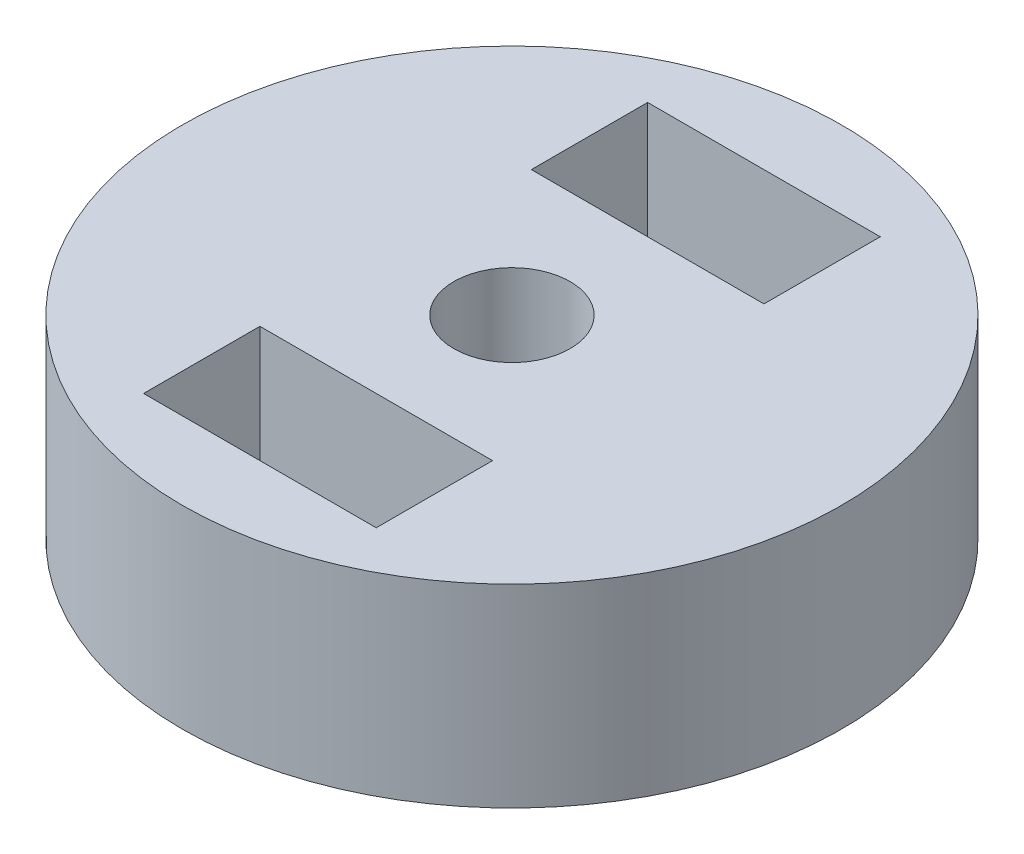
ISO-10303-21;
HEADER;
FILE_DESCRIPTION(('STEP AP214'),'2;1');
FILE_NAME('part.step','',(''),(''),'','','');
FILE_SCHEMA(('AUTOMOTIVE_DESIGN { 1 0 10303 214 1 1 1 1 }'));
ENDSEC;
DATA;
#1=APPLICATION_CONTEXT('core data for automotive mechanical design processes');
#2=APPLICATION_PROTOCOL_DEFINITION('international standard','automotive_design',2000,#1);
#3=PRODUCT_CONTEXT('',#1,'mechanical');
#4=PRODUCT('Part','Part','',(#3));
#5=PRODUCT_RELATED_PRODUCT_CATEGORY('part','',(#4));
#6=PRODUCT_DEFINITION_FORMATION('','',#4);
#7=PRODUCT_DEFINITION_CONTEXT('part definition',#1,'design');
#8=PRODUCT_DEFINITION('design','',#6,#7);
#9=PRODUCT_DEFINITION_SHAPE('','',#8);
#10=(LENGTH_UNIT() NAMED_UNIT(*) SI_UNIT(.MILLI.,.METRE.));
#11=(NAMED_UNIT(*) PLANE_ANGLE_UNIT() SI_UNIT($,.RADIAN.));
#12=(NAMED_UNIT(*) SI_UNIT($,.STERADIAN.) SOLID_ANGLE_UNIT());
#13=UNCERTAINTY_MEASURE_WITH_UNIT(LENGTH_MEASURE(1.E-05),#10,'distance_accuracy_value','');
#14=(GEOMETRIC_REPRESENTATION_CONTEXT(3) GLOBAL_UNCERTAINTY_ASSIGNED_CONTEXT((#13)) GLOBAL_UNIT_ASSIGNED_CONTEXT((#10,
#11,#12)) REPRESENTATION_CONTEXT('',''));
#15=CARTESIAN_POINT('',(0.,0.,0.));
#16=DIRECTION('',(0.,0.,1.));
#17=DIRECTION('',(1.,0.,0.));
#18=AXIS2_PLACEMENT_3D('',#15,#16,#17);
#19=CARTESIAN_POINT('',(0.,5.,0.));
#20=DIRECTION('',(0.,1.,0.));
#21=DIRECTION('',(0.,0.,1.));
#22=AXIS2_PLACEMENT_3D('',#19,#20,#21);
#23=PLANE('',#22);
#24=DIRECTION('',(0.,0.,1.));
#25=VECTOR('',#24,1.);
#26=CARTESIAN_POINT('',(-3.,5.,3.5));
#27=LINE('',#26,#25);
#28=CARTESIAN_POINT('',(-3.,5.,3.5));
#29=VERTEX_POINT('',#28);
#30=CARTESIAN_POINT('',(-3.,5.,6.5));
#31=VERTEX_POINT('',#30);
#32=EDGE_CURVE('E48',#29,#31,#27,.T.);
#33=ORIENTED_EDGE('',*,*,#32,.F.);
#34=DIRECTION('',(-1.,0.,0.));
#35=VECTOR('',#34,1.);
#36=CARTESIAN_POINT('',(-3.,5.,3.5));
#37=LINE('',#36,#35);
#38=CARTESIAN_POINT('',(3.,5.,3.5));
#39=VERTEX_POINT('',#38);
#40=EDGE_CURVE('E119',#39,#29,#37,.T.);
#41=ORIENTED_EDGE('',*,*,#40,.F.);
#42=DIRECTION('',(0.,0.,-1.));
#43=VECTOR('',#42,1.);
#44=CARTESIAN_POINT('',(3.,5.,6.5));
#45=LINE('',#44,#43);
#46=CARTESIAN_POINT('',(3.,5.,6.5));
#47=VERTEX_POINT('',#46);
#48=EDGE_CURVE('E122',#47,#39,#45,.T.);
#49=ORIENTED_EDGE('',*,*,#48,.F.);
#50=DIRECTION('',(1.,0.,0.));
#51=VECTOR('',#50,1.);
#52=CARTESIAN_POINT('',(-3.,5.,6.5));
#53=LINE('',#52,#51);
#54=EDGE_CURVE('E128',#31,#47,#53,.T.);
#55=ORIENTED_EDGE('',*,*,#54,.F.);
#56=EDGE_LOOP('',(#33,#41,#49,#55));
#57=FACE_BOUND('',#56,.T.);
#58=DIRECTION('',(0.,0.,1.));
#59=VECTOR('',#58,1.);
#60=CARTESIAN_POINT('',(-3.,5.,-6.5));
#61=LINE('',#60,#59);
#62=CARTESIAN_POINT('',(-3.,5.,-6.5));
#63=VERTEX_POINT('',#62);
#64=CARTESIAN_POINT('',(-3.,5.,-3.5));
#65=VERTEX_POINT('',#64);
#66=EDGE_CURVE('E56',#63,#65,#61,.T.);
#67=ORIENTED_EDGE('',*,*,#66,.F.);
#68=DIRECTION('',(-1.,0.,0.));
#69=VECTOR('',#68,1.);
#70=CARTESIAN_POINT('',(3.,5.,-6.5));
#71=LINE('',#70,#69);
#72=CARTESIAN_POINT('',(3.,5.,-6.5));
#73=VERTEX_POINT('',#72);
#74=EDGE_CURVE('E143',#73,#63,#71,.T.);
#75=ORIENTED_EDGE('',*,*,#74,.F.);
#76=DIRECTION('',(0.,0.,-1.));
#77=VECTOR('',#76,1.);
#78=CARTESIAN_POINT('',(3.,5.,-3.5));
#79=LINE('',#78,#77);
#80=CARTESIAN_POINT('',(3.,5.,-3.5));
#81=VERTEX_POINT('',#80);
#82=EDGE_CURVE('E157',#81,#73,#79,.T.);
#83=ORIENTED_EDGE('',*,*,#82,.F.);
#84=DIRECTION('',(1.,0.,0.));
#85=VECTOR('',#84,1.);
#86=CARTESIAN_POINT('',(-3.,5.,-3.5));
#87=LINE('',#86,#85);
#88=EDGE_CURVE('E154',#65,#81,#87,.T.);
#89=ORIENTED_EDGE('',*,*,#88,.F.);
#90=EDGE_LOOP('',(#67,#75,#83,#89));
#91=FACE_BOUND('',#90,.T.);
#92=CARTESIAN_POINT('',(0.,5.,0.));
#93=DIRECTION('',(0.,1.,0.));
#94=DIRECTION('',(0.,0.,1.));
#95=AXIS2_PLACEMENT_3D('',#92,#93,#94);
#96=CIRCLE('',#95,8.5);
#97=CARTESIAN_POINT('',(0.,5.,8.5));
#98=VERTEX_POINT('',#97);
#99=EDGE_CURVE('E11',#98,#98,#96,.T.);
#100=ORIENTED_EDGE('',*,*,#99,.T.);
#101=EDGE_LOOP('',(#100));
#102=FACE_BOUND('',#101,.T.);
#103=CARTESIAN_POINT('',(0.,5.,0.));
#104=DIRECTION('',(0.,1.,0.));
#105=DIRECTION('',(0.,0.,1.));
#106=AXIS2_PLACEMENT_3D('',#103,#104,#105);
#107=CIRCLE('',#106,1.5);
#108=CARTESIAN_POINT('',(0.,5.,1.5));
#109=VERTEX_POINT('',#108);
#110=EDGE_CURVE('E168',#109,#109,#107,.T.);
#111=ORIENTED_EDGE('',*,*,#110,.F.);
#112=EDGE_LOOP('',(#111));
#113=FACE_BOUND('',#112,.T.);
#114=ADVANCED_FACE('F33',(#57,#91,#102,#113),#23,.T.);
#115=CARTESIAN_POINT('',(0.,0.,0.));
#116=DIRECTION('',(0.,1.,0.));
#117=DIRECTION('',(0.,0.,1.));
#118=AXIS2_PLACEMENT_3D('',#115,#116,#117);
#119=PLANE('',#118);
#120=DIRECTION('',(-1.,0.,0.));
#121=VECTOR('',#120,1.);
#122=CARTESIAN_POINT('',(-3.,0.,3.5));
#123=LINE('',#122,#121);
#124=CARTESIAN_POINT('',(3.,0.,3.5));
#125=VERTEX_POINT('',#124);
#126=CARTESIAN_POINT('',(-3.,0.,3.5));
#127=VERTEX_POINT('',#126);
#128=EDGE_CURVE('E106',#125,#127,#123,.T.);
#129=ORIENTED_EDGE('',*,*,#128,.T.);
#130=DIRECTION('',(0.,0.,1.));
#131=VECTOR('',#130,1.);
#132=CARTESIAN_POINT('',(-3.,0.,3.5));
#133=LINE('',#132,#131);
#134=CARTESIAN_POINT('',(-3.,0.,6.5));
#135=VERTEX_POINT('',#134);
#136=EDGE_CURVE('E100',#127,#135,#133,.T.);
#137=ORIENTED_EDGE('',*,*,#136,.T.);
#138=DIRECTION('',(1.,0.,0.));
#139=VECTOR('',#138,1.);
#140=CARTESIAN_POINT('',(-3.,0.,6.5));
#141=LINE('',#140,#139);
#142=CARTESIAN_POINT('',(3.,0.,6.5));
#143=VERTEX_POINT('',#142);
#144=EDGE_CURVE('E110',#135,#143,#141,.T.);
#145=ORIENTED_EDGE('',*,*,#144,.T.);
#146=DIRECTION('',(0.,0.,-1.));
#147=VECTOR('',#146,1.);
#148=CARTESIAN_POINT('',(3.,0.,6.5));
#149=LINE('',#148,#147);
#150=EDGE_CURVE('E114',#143,#125,#149,.T.);
#151=ORIENTED_EDGE('',*,*,#150,.T.);
#152=EDGE_LOOP('',(#129,#137,#145,#151));
#153=FACE_BOUND('',#152,.T.);
#154=DIRECTION('',(-1.,0.,0.));
#155=VECTOR('',#154,1.);
#156=CARTESIAN_POINT('',(3.,0.,-6.5));
#157=LINE('',#156,#155);
#158=CARTESIAN_POINT('',(3.,0.,-6.5));
#159=VERTEX_POINT('',#158);
#160=CARTESIAN_POINT('',(-3.,0.,-6.5));
#161=VERTEX_POINT('',#160);
#162=EDGE_CURVE('E149',#159,#161,#157,.T.);
#163=ORIENTED_EDGE('',*,*,#162,.T.);
#164=DIRECTION('',(0.,0.,1.));
#165=VECTOR('',#164,1.);
#166=CARTESIAN_POINT('',(-3.,0.,-6.5));
#167=LINE('',#166,#165);
#168=CARTESIAN_POINT('',(-3.,0.,-3.5));
#169=VERTEX_POINT('',#168);
#170=EDGE_CURVE('E139',#161,#169,#167,.T.);
#171=ORIENTED_EDGE('',*,*,#170,.T.);
#172=DIRECTION('',(1.,0.,0.));
#173=VECTOR('',#172,1.);
#174=CARTESIAN_POINT('',(-3.,0.,-3.5));
#175=LINE('',#174,#173);
#176=CARTESIAN_POINT('',(3.,0.,-3.5));
#177=VERTEX_POINT('',#176);
#178=EDGE_CURVE('E142',#169,#177,#175,.T.);
#179=ORIENTED_EDGE('',*,*,#178,.T.);
#180=DIRECTION('',(0.,0.,-1.));
#181=VECTOR('',#180,1.);
#182=CARTESIAN_POINT('',(3.,0.,-3.5));
#183=LINE('',#182,#181);
#184=EDGE_CURVE('E146',#177,#159,#183,.T.);
#185=ORIENTED_EDGE('',*,*,#184,.T.);
#186=EDGE_LOOP('',(#163,#171,#179,#185));
#187=FACE_BOUND('',#186,.T.);
#188=CARTESIAN_POINT('',(0.,0.,0.));
#189=DIRECTION('',(0.,1.,0.));
#190=DIRECTION('',(0.,0.,1.));
#191=AXIS2_PLACEMENT_3D('',#188,#189,#190);
#192=CIRCLE('',#191,8.5);
#193=CARTESIAN_POINT('',(0.,0.,8.5));
#194=VERTEX_POINT('',#193);
#195=EDGE_CURVE('E37',#194,#194,#192,.T.);
#196=ORIENTED_EDGE('',*,*,#195,.F.);
#197=EDGE_LOOP('',(#196));
#198=FACE_BOUND('',#197,.T.);
#199=CARTESIAN_POINT('',(0.,0.,0.));
#200=DIRECTION('',(0.,1.,0.));
#201=DIRECTION('',(0.,0.,1.));
#202=AXIS2_PLACEMENT_3D('',#199,#200,#201);
#203=CIRCLE('',#202,1.5);
#204=CARTESIAN_POINT('',(0.,0.,1.5));
#205=VERTEX_POINT('',#204);
#206=EDGE_CURVE('E135',#205,#205,#203,.T.);
#207=ORIENTED_EDGE('',*,*,#206,.T.);
#208=EDGE_LOOP('',(#207));
#209=FACE_BOUND('',#208,.T.);
#210=ADVANCED_FACE('F116',(#153,#187,#198,#209),#119,.F.);
#211=CARTESIAN_POINT('',(0.,5.,0.));
#212=DIRECTION('',(0.,-1.,0.));
#213=DIRECTION('',(0.,0.,-1.));
#214=AXIS2_PLACEMENT_3D('',#211,#212,#213);
#215=CYLINDRICAL_SURFACE('',#214,8.5);
#216=ORIENTED_EDGE('',*,*,#99,.F.);
#217=EDGE_LOOP('',(#216));
#218=FACE_BOUND('',#217,.T.);
#219=ORIENTED_EDGE('',*,*,#195,.T.);
#220=EDGE_LOOP('',(#219));
#221=FACE_BOUND('',#220,.T.);
#222=ADVANCED_FACE('F35',(#218,#221),#215,.T.);
#223=CARTESIAN_POINT('',(0.,5.,0.));
#224=DIRECTION('',(0.,-1.,0.));
#225=DIRECTION('',(0.,0.,-1.));
#226=AXIS2_PLACEMENT_3D('',#223,#224,#225);
#227=CYLINDRICAL_SURFACE('',#226,1.5);
#228=ORIENTED_EDGE('',*,*,#110,.T.);
#229=EDGE_LOOP('',(#228));
#230=FACE_BOUND('',#229,.T.);
#231=ORIENTED_EDGE('',*,*,#206,.F.);
#232=EDGE_LOOP('',(#231));
#233=FACE_BOUND('',#232,.T.);
#234=ADVANCED_FACE('F175',(#230,#233),#227,.F.);
#235=CARTESIAN_POINT('',(-3.,0.,-6.5));
#236=DIRECTION('',(-1.,0.,0.));
#237=DIRECTION('',(0.,0.,1.));
#238=AXIS2_PLACEMENT_3D('',#235,#236,#237);
#239=PLANE('',#238);
#240=ORIENTED_EDGE('',*,*,#66,.T.);
#241=DIRECTION('',(0.,1.,0.));
#242=VECTOR('',#241,1.);
#243=CARTESIAN_POINT('',(-3.,0.,-3.5));
#244=LINE('',#243,#242);
#245=EDGE_CURVE('E152',#169,#65,#244,.T.);
#246=ORIENTED_EDGE('',*,*,#245,.F.);
#247=ORIENTED_EDGE('',*,*,#170,.F.);
#248=DIRECTION('',(0.,1.,0.));
#249=VECTOR('',#248,1.);
#250=CARTESIAN_POINT('',(-3.,0.,-6.5));
#251=LINE('',#250,#249);
#252=EDGE_CURVE('E129',#161,#63,#251,.T.);
#253=ORIENTED_EDGE('',*,*,#252,.T.);
#254=EDGE_LOOP('',(#240,#246,#247,#253));
#255=FACE_BOUND('',#254,.T.);
#256=ADVANCED_FACE('F177',(#255),#239,.F.);
#257=CARTESIAN_POINT('',(3.,0.,-6.5));
#258=DIRECTION('',(0.,0.,-1.));
#259=DIRECTION('',(-1.,0.,0.));
#260=AXIS2_PLACEMENT_3D('',#257,#258,#259);
#261=PLANE('',#260);
#262=ORIENTED_EDGE('',*,*,#74,.T.);
#263=ORIENTED_EDGE('',*,*,#252,.F.);
#264=ORIENTED_EDGE('',*,*,#162,.F.);
#265=DIRECTION('',(0.,1.,0.));
#266=VECTOR('',#265,1.);
#267=CARTESIAN_POINT('',(3.,0.,-6.5));
#268=LINE('',#267,#266);
#269=EDGE_CURVE('E163',#159,#73,#268,.T.);
#270=ORIENTED_EDGE('',*,*,#269,.T.);
#271=EDGE_LOOP('',(#262,#263,#264,#270));
#272=FACE_BOUND('',#271,.T.);
#273=ADVANCED_FACE('F184',(#272),#261,.F.);
#274=CARTESIAN_POINT('',(3.,0.,-3.5));
#275=DIRECTION('',(1.,0.,0.));
#276=DIRECTION('',(0.,0.,-1.));
#277=AXIS2_PLACEMENT_3D('',#274,#275,#276);
#278=PLANE('',#277);
#279=ORIENTED_EDGE('',*,*,#82,.T.);
#280=ORIENTED_EDGE('',*,*,#269,.F.);
#281=ORIENTED_EDGE('',*,*,#184,.F.);
#282=DIRECTION('',(0.,1.,0.));
#283=VECTOR('',#282,1.);
#284=CARTESIAN_POINT('',(3.,0.,-3.5));
#285=LINE('',#284,#283);
#286=EDGE_CURVE('E165',#177,#81,#285,.T.);
#287=ORIENTED_EDGE('',*,*,#286,.T.);
#288=EDGE_LOOP('',(#279,#280,#281,#287));
#289=FACE_BOUND('',#288,.T.);
#290=ADVANCED_FACE('F214',(#289),#278,.F.);
#291=CARTESIAN_POINT('',(-3.,0.,-3.5));
#292=DIRECTION('',(0.,0.,1.));
#293=DIRECTION('',(1.,0.,0.));
#294=AXIS2_PLACEMENT_3D('',#291,#292,#293);
#295=PLANE('',#294);
#296=ORIENTED_EDGE('',*,*,#88,.T.);
#297=ORIENTED_EDGE('',*,*,#286,.F.);
#298=ORIENTED_EDGE('',*,*,#178,.F.);
#299=ORIENTED_EDGE('',*,*,#245,.T.);
#300=EDGE_LOOP('',(#296,#297,#298,#299));
#301=FACE_BOUND('',#300,.T.);
#302=ADVANCED_FACE('F208',(#301),#295,.F.);
#303=CARTESIAN_POINT('',(-3.,0.,3.5));
#304=DIRECTION('',(-1.,0.,0.));
#305=DIRECTION('',(0.,0.,1.));
#306=AXIS2_PLACEMENT_3D('',#303,#304,#305);
#307=PLANE('',#306);
#308=ORIENTED_EDGE('',*,*,#32,.T.);
#309=DIRECTION('',(0.,1.,0.));
#310=VECTOR('',#309,1.);
#311=CARTESIAN_POINT('',(-3.,0.,6.5));
#312=LINE('',#311,#310);
#313=EDGE_CURVE('E96',#135,#31,#312,.T.);
#314=ORIENTED_EDGE('',*,*,#313,.F.);
#315=ORIENTED_EDGE('',*,*,#136,.F.);
#316=DIRECTION('',(0.,1.,0.));
#317=VECTOR('',#316,1.);
#318=CARTESIAN_POINT('',(-3.,0.,3.5));
#319=LINE('',#318,#317);
#320=EDGE_CURVE('E133',#127,#29,#319,.T.);
#321=ORIENTED_EDGE('',*,*,#320,.T.);
#322=EDGE_LOOP('',(#308,#314,#315,#321));
#323=FACE_BOUND('',#322,.T.);
#324=ADVANCED_FACE('F98',(#323),#307,.F.);
#325=CARTESIAN_POINT('',(-3.,0.,3.5));
#326=DIRECTION('',(0.,0.,-1.));
#327=DIRECTION('',(-1.,0.,0.));
#328=AXIS2_PLACEMENT_3D('',#325,#326,#327);
#329=PLANE('',#328);
#330=ORIENTED_EDGE('',*,*,#40,.T.);
#331=ORIENTED_EDGE('',*,*,#320,.F.);
#332=ORIENTED_EDGE('',*,*,#128,.F.);
#333=DIRECTION('',(0.,1.,0.));
#334=VECTOR('',#333,1.);
#335=CARTESIAN_POINT('',(3.,0.,3.5));
#336=LINE('',#335,#334);
#337=EDGE_CURVE('E136',#125,#39,#336,.T.);
#338=ORIENTED_EDGE('',*,*,#337,.T.);
#339=EDGE_LOOP('',(#330,#331,#332,#338));
#340=FACE_BOUND('',#339,.T.);
#341=ADVANCED_FACE('F226',(#340),#329,.F.);
#342=CARTESIAN_POINT('',(3.,0.,6.5));
#343=DIRECTION('',(1.,0.,0.));
#344=DIRECTION('',(0.,0.,-1.));
#345=AXIS2_PLACEMENT_3D('',#342,#343,#344);
#346=PLANE('',#345);
#347=ORIENTED_EDGE('',*,*,#48,.T.);
#348=ORIENTED_EDGE('',*,*,#337,.F.);
#349=ORIENTED_EDGE('',*,*,#150,.F.);
#350=DIRECTION('',(0.,1.,0.));
#351=VECTOR('',#350,1.);
#352=CARTESIAN_POINT('',(3.,0.,6.5));
#353=LINE('',#352,#351);
#354=EDGE_CURVE('E105',#143,#47,#353,.T.);
#355=ORIENTED_EDGE('',*,*,#354,.T.);
#356=EDGE_LOOP('',(#347,#348,#349,#355));
#357=FACE_BOUND('',#356,.T.);
#358=ADVANCED_FACE('F229',(#357),#346,.F.);
#359=CARTESIAN_POINT('',(-3.,0.,6.5));
#360=DIRECTION('',(0.,0.,1.));
#361=DIRECTION('',(1.,0.,0.));
#362=AXIS2_PLACEMENT_3D('',#359,#360,#361);
#363=PLANE('',#362);
#364=ORIENTED_EDGE('',*,*,#54,.T.);
#365=ORIENTED_EDGE('',*,*,#354,.F.);
#366=ORIENTED_EDGE('',*,*,#144,.F.);
#367=ORIENTED_EDGE('',*,*,#313,.T.);
#368=EDGE_LOOP('',(#364,#365,#366,#367));
#369=FACE_BOUND('',#368,.T.);
#370=ADVANCED_FACE('F111',(#369),#363,.F.);
#371=CLOSED_SHELL('',(#114,#210,#222,#234,#256,#273,#290,#302,#324,#341,#358,#370));
#372=MANIFOLD_SOLID_BREP('B2',#371);
#373=ADVANCED_BREP_SHAPE_REPRESENTATION('',(#18,#372),#14);
#374=SHAPE_DEFINITION_REPRESENTATION(#9,#373);
ENDSEC;
END-ISO-10303-21;
